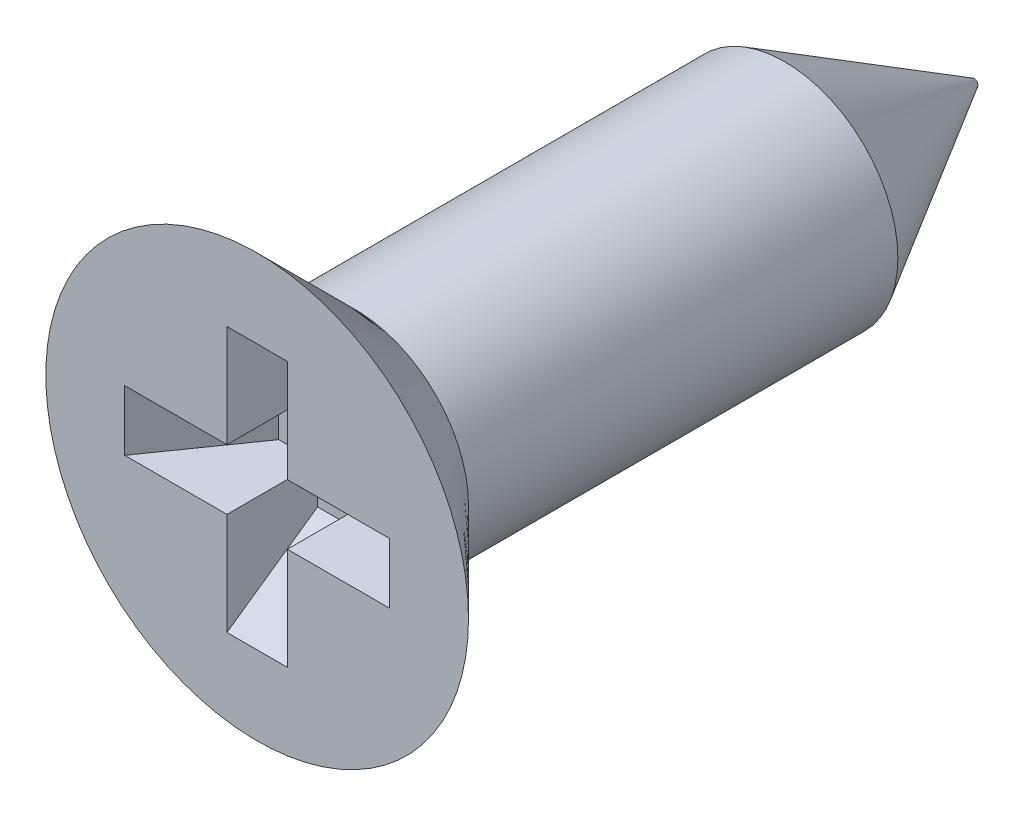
ISO-10303-21;
HEADER;
FILE_DESCRIPTION(('STEP AP214'),'2;1');
FILE_NAME('part.step','',(''),(''),'','','');
FILE_SCHEMA(('AUTOMOTIVE_DESIGN { 1 0 10303 214 1 1 1 1 }'));
ENDSEC;
DATA;
#1=APPLICATION_CONTEXT('core data for automotive mechanical design processes');
#2=APPLICATION_PROTOCOL_DEFINITION('international standard','automotive_design',2000,#1);
#3=PRODUCT_CONTEXT('',#1,'mechanical');
#4=PRODUCT('Part','Part','',(#3));
#5=PRODUCT_RELATED_PRODUCT_CATEGORY('part','',(#4));
#6=PRODUCT_DEFINITION_FORMATION('','',#4);
#7=PRODUCT_DEFINITION_CONTEXT('part definition',#1,'design');
#8=PRODUCT_DEFINITION('design','',#6,#7);
#9=PRODUCT_DEFINITION_SHAPE('','',#8);
#10=(LENGTH_UNIT() NAMED_UNIT(*) SI_UNIT(.MILLI.,.METRE.));
#11=(NAMED_UNIT(*) PLANE_ANGLE_UNIT() SI_UNIT($,.RADIAN.));
#12=(NAMED_UNIT(*) SI_UNIT($,.STERADIAN.) SOLID_ANGLE_UNIT());
#13=UNCERTAINTY_MEASURE_WITH_UNIT(LENGTH_MEASURE(1.E-05),#10,'distance_accuracy_value','');
#14=(GEOMETRIC_REPRESENTATION_CONTEXT(3) GLOBAL_UNCERTAINTY_ASSIGNED_CONTEXT((#13)) GLOBAL_UNIT_ASSIGNED_CONTEXT((#10,
#11,#12)) REPRESENTATION_CONTEXT('',''));
#15=CARTESIAN_POINT('',(0.,0.,0.));
#16=DIRECTION('',(0.,0.,1.));
#17=DIRECTION('',(1.,0.,0.));
#18=AXIS2_PLACEMENT_3D('',#15,#16,#17);
#19=CARTESIAN_POINT('',(-1.75499287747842,-0.4,0.));
#20=DIRECTION('',(0.819152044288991,0.,0.573576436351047));
#21=DIRECTION('',(0.573576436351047,0.,-0.819152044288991));
#22=AXIS2_PLACEMENT_3D('',#19,#20,#21);
#23=PLANE('',#22);
#24=DIRECTION('',(0.,1.,0.));
#25=VECTOR('',#24,1.);
#26=CARTESIAN_POINT('',(0.,0.4,-2.50638957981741));
#27=LINE('',#26,#25);
#28=CARTESIAN_POINT('',(0.,-0.29361042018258,-2.50638957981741));
#29=VERTEX_POINT('',#28);
#30=CARTESIAN_POINT('',(0.,0.,-2.50638957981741));
#31=VERTEX_POINT('',#30);
#32=EDGE_CURVE('E345',#29,#31,#27,.T.);
#33=ORIENTED_EDGE('',*,*,#32,.F.);
#34=CARTESIAN_POINT('',(0.103438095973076,-0.102874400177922,-2.65411449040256));
#35=CARTESIAN_POINT('',(0.09992365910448,-0.113485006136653,-2.64909535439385));
#36=CARTESIAN_POINT('',(0.096077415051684,-0.123726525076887,-2.64360234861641));
#37=CARTESIAN_POINT('',(0.0878958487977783,-0.143557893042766,-2.63191786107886));
#38=CARTESIAN_POINT('',(0.0835619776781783,-0.153149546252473,-2.62572845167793));
#39=CARTESIAN_POINT('',(0.0745900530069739,-0.171760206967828,-2.61291521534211));
#40=CARTESIAN_POINT('',(0.0699544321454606,-0.180782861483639,-2.60629486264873));
#41=CARTESIAN_POINT('',(0.0604348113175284,-0.198432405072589,-2.59269943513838));
#42=CARTESIAN_POINT('',(0.0555506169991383,-0.207058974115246,-2.58572408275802));
#43=CARTESIAN_POINT('',(0.0425194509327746,-0.229237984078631,-2.56711364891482));
#44=CARTESIAN_POINT('',(0.0342270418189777,-0.242528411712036,-2.55527086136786));
#45=CARTESIAN_POINT('',(0.0172728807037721,-0.268554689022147,-2.5310578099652));
#46=CARTESIAN_POINT('',(0.00860925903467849,-0.28128685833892,-2.51868487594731));
#47=CARTESIAN_POINT('',(-0.000140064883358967,-0.2938104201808,-2.50618954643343));
#48=B_SPLINE_CURVE_WITH_KNOTS('',3,(#34,#35,#36,#37,#38,#39,#40,#41,#42,#43,#44,#45,#46,#47),
.UNSPECIFIED.,.F.,.F.,(4,2,2,2,2,2,4),(0.,0.036695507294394,0.0732845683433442,
0.109608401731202,0.145961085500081,0.204852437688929,0.264086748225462),.UNSPECIFIED.);
#49=CARTESIAN_POINT('',(0.103298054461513,-0.103298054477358,-2.65391449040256));
#50=VERTEX_POINT('',#49);
#51=EDGE_CURVE('E279',#50,#29,#48,.T.);
#52=ORIENTED_EDGE('',*,*,#51,.F.);
#53=DIRECTION('',(-0.497542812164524,0.497542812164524,0.710564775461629));
#54=VECTOR('',#53,1.);
#55=CARTESIAN_POINT('',(-1.41956594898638,1.41956594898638,-0.479039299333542));
#56=LINE('',#55,#54);
#57=EDGE_CURVE('E343',#50,#31,#56,.T.);
#58=ORIENTED_EDGE('',*,*,#57,.T.);
#59=EDGE_LOOP('',(#33,#52,#58));
#60=FACE_BOUND('',#59,.T.);
#61=ADVANCED_FACE('F17',(#60),#23,.T.);
#62=DIRECTION('',(0.,1.,0.));
#63=VECTOR('',#62,1.);
#64=CARTESIAN_POINT('',(-0.91474383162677,-0.4,-1.2));
#65=LINE('',#64,#63);
#66=CARTESIAN_POINT('',(-0.91474383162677,0.4,-1.2));
#67=VERTEX_POINT('',#66);
#68=CARTESIAN_POINT('',(-0.91474383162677,-0.4,-1.2));
#69=VERTEX_POINT('',#68);
#70=EDGE_CURVE('E339',#67,#69,#65,.F.);
#71=ORIENTED_EDGE('',*,*,#70,.F.);
#72=DIRECTION('',(0.573576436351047,0.,-0.819152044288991));
#73=VECTOR('',#72,1.);
#74=CARTESIAN_POINT('',(-1.19117730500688,0.4,-0.8052120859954));
#75=LINE('',#74,#73);
#76=CARTESIAN_POINT('',(-1.75499287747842,0.4,0.));
#77=VERTEX_POINT('',#76);
#78=EDGE_CURVE('E222',#67,#77,#75,.F.);
#79=ORIENTED_EDGE('',*,*,#78,.T.);
#80=DIRECTION('',(0.,-1.,0.));
#81=VECTOR('',#80,1.);
#82=CARTESIAN_POINT('',(-1.75499287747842,-0.4,0.));
#83=LINE('',#82,#81);
#84=CARTESIAN_POINT('',(-1.75499287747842,-0.4,0.));
#85=VERTEX_POINT('',#84);
#86=EDGE_CURVE('E163',#77,#85,#83,.T.);
#87=ORIENTED_EDGE('',*,*,#86,.T.);
#88=DIRECTION('',(0.573576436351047,0.,-0.819152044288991));
#89=VECTOR('',#88,1.);
#90=CARTESIAN_POINT('',(-1.75499287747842,-0.4,0.));
#91=LINE('',#90,#89);
#92=EDGE_CURVE('E154',#69,#85,#91,.F.);
#93=ORIENTED_EDGE('',*,*,#92,.F.);
#94=EDGE_LOOP('',(#71,#79,#87,#93));
#95=FACE_BOUND('',#94,.T.);
#96=ADVANCED_FACE('F273',(#95),#23,.T.);
#97=CARTESIAN_POINT('',(0.4,-1.75499287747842,0.));
#98=DIRECTION('',(0.,0.819152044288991,0.573576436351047));
#99=DIRECTION('',(0.,-0.573576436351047,0.819152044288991));
#100=AXIS2_PLACEMENT_3D('',#97,#98,#99);
#101=PLANE('',#100);
#102=DIRECTION('',(-1.,0.,0.));
#103=VECTOR('',#102,1.);
#104=CARTESIAN_POINT('',(0.4,-0.91474383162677,-1.2));
#105=LINE('',#104,#103);
#106=CARTESIAN_POINT('',(-0.4,-0.91474383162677,-1.2));
#107=VERTEX_POINT('',#106);
#108=CARTESIAN_POINT('',(0.4,-0.91474383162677,-1.2));
#109=VERTEX_POINT('',#108);
#110=EDGE_CURVE('E337',#107,#109,#105,.F.);
#111=ORIENTED_EDGE('',*,*,#110,.F.);
#112=DIRECTION('',(0.,0.573576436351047,-0.819152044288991));
#113=VECTOR('',#112,1.);
#114=CARTESIAN_POINT('',(-0.4,-0.74539829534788,-1.44185049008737));
#115=LINE('',#114,#113);
#116=CARTESIAN_POINT('',(-0.4,-1.75499287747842,0.));
#117=VERTEX_POINT('',#116);
#118=EDGE_CURVE('E153',#107,#117,#115,.F.);
#119=ORIENTED_EDGE('',*,*,#118,.T.);
#120=DIRECTION('',(1.,0.,0.));
#121=VECTOR('',#120,1.);
#122=CARTESIAN_POINT('',(0.4,-1.75499287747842,0.));
#123=LINE('',#122,#121);
#124=CARTESIAN_POINT('',(0.4,-1.75499287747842,0.));
#125=VERTEX_POINT('',#124);
#126=EDGE_CURVE('E169',#117,#125,#123,.T.);
#127=ORIENTED_EDGE('',*,*,#126,.T.);
#128=DIRECTION('',(0.,0.573576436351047,-0.819152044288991));
#129=VECTOR('',#128,1.);
#130=CARTESIAN_POINT('',(0.4,-1.75499287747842,0.));
#131=LINE('',#130,#129);
#132=EDGE_CURVE('E230',#109,#125,#131,.F.);
#133=ORIENTED_EDGE('',*,*,#132,.F.);
#134=EDGE_LOOP('',(#111,#119,#127,#133));
#135=FACE_BOUND('',#134,.T.);
#136=ADVANCED_FACE('F269',(#135),#101,.T.);
#137=CARTESIAN_POINT('',(-1.75499287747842,1.75499287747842,-1.2));
#138=DIRECTION('',(0.,0.,-1.));
#139=DIRECTION('',(-1.,0.,0.));
#140=AXIS2_PLACEMENT_3D('',#137,#138,#139);
#141=PLANE('',#140);
#142=DIRECTION('',(0.,-1.,0.));
#143=VECTOR('',#142,1.);
#144=CARTESIAN_POINT('',(-0.4,1.75499287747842,-1.2));
#145=LINE('',#144,#143);
#146=CARTESIAN_POINT('',(-0.4,1.54919333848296,-1.2));
#147=VERTEX_POINT('',#146);
#148=CARTESIAN_POINT('',(-0.4,0.91474383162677,-1.2));
#149=VERTEX_POINT('',#148);
#150=EDGE_CURVE('E213',#147,#149,#145,.T.);
#151=ORIENTED_EDGE('',*,*,#150,.T.);
#152=CARTESIAN_POINT('',(-0.4,0.4,-1.2));
#153=VERTEX_POINT('',#152);
#154=EDGE_CURVE('E214',#149,#153,#145,.T.);
#155=ORIENTED_EDGE('',*,*,#154,.T.);
#156=DIRECTION('',(-1.,0.,0.));
#157=VECTOR('',#156,1.);
#158=CARTESIAN_POINT('',(-1.75499287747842,0.4,-1.2));
#159=LINE('',#158,#157);
#160=EDGE_CURVE('E217',#153,#67,#159,.T.);
#161=ORIENTED_EDGE('',*,*,#160,.T.);
#162=ORIENTED_EDGE('',*,*,#70,.T.);
#163=DIRECTION('',(1.,0.,0.));
#164=VECTOR('',#163,1.);
#165=CARTESIAN_POINT('',(-1.75499287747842,-0.4,-1.2));
#166=LINE('',#165,#164);
#167=CARTESIAN_POINT('',(-0.4,-0.4,-1.2));
#168=VERTEX_POINT('',#167);
#169=EDGE_CURVE('E198',#69,#168,#166,.T.);
#170=ORIENTED_EDGE('',*,*,#169,.T.);
#171=DIRECTION('',(0.,-1.,0.));
#172=VECTOR('',#171,1.);
#173=CARTESIAN_POINT('',(-0.4,-0.4,-1.2));
#174=LINE('',#173,#172);
#175=EDGE_CURVE('E149',#168,#107,#174,.T.);
#176=ORIENTED_EDGE('',*,*,#175,.T.);
#177=ORIENTED_EDGE('',*,*,#110,.T.);
#178=DIRECTION('',(0.,1.,0.));
#179=VECTOR('',#178,1.);
#180=CARTESIAN_POINT('',(0.4,-0.4,-1.2));
#181=LINE('',#180,#179);
#182=CARTESIAN_POINT('',(0.4,-0.4,-1.2));
#183=VERTEX_POINT('',#182);
#184=EDGE_CURVE('E201',#109,#183,#181,.T.);
#185=ORIENTED_EDGE('',*,*,#184,.T.);
#186=DIRECTION('',(1.,0.,0.));
#187=VECTOR('',#186,1.);
#188=CARTESIAN_POINT('',(0.4,-0.4,-1.2));
#189=LINE('',#188,#187);
#190=CARTESIAN_POINT('',(0.91474383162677,-0.4,-1.2));
#191=VERTEX_POINT('',#190);
#192=EDGE_CURVE('E204',#183,#191,#189,.T.);
#193=ORIENTED_EDGE('',*,*,#192,.T.);
#194=DIRECTION('',(0.,-1.,0.));
#195=VECTOR('',#194,1.);
#196=CARTESIAN_POINT('',(0.91474383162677,0.4,-1.2));
#197=LINE('',#196,#195);
#198=CARTESIAN_POINT('',(0.91474383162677,0.4,-1.2));
#199=VERTEX_POINT('',#198);
#200=EDGE_CURVE('E330',#191,#199,#197,.F.);
#201=ORIENTED_EDGE('',*,*,#200,.T.);
#202=DIRECTION('',(-1.,0.,0.));
#203=VECTOR('',#202,1.);
#204=CARTESIAN_POINT('',(0.4,0.4,-1.2));
#205=LINE('',#204,#203);
#206=CARTESIAN_POINT('',(0.4,0.4,-1.2));
#207=VERTEX_POINT('',#206);
#208=EDGE_CURVE('E207',#199,#207,#205,.T.);
#209=ORIENTED_EDGE('',*,*,#208,.T.);
#210=DIRECTION('',(0.,1.,0.));
#211=VECTOR('',#210,1.);
#212=CARTESIAN_POINT('',(0.4,1.75499287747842,-1.2));
#213=LINE('',#212,#211);
#214=CARTESIAN_POINT('',(0.4,0.91474383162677,-1.2));
#215=VERTEX_POINT('',#214);
#216=EDGE_CURVE('E210',#207,#215,#213,.T.);
#217=ORIENTED_EDGE('',*,*,#216,.T.);
#218=CARTESIAN_POINT('',(0.4,1.54919333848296,-1.2));
#219=VERTEX_POINT('',#218);
#220=EDGE_CURVE('E211',#215,#219,#213,.T.);
#221=ORIENTED_EDGE('',*,*,#220,.T.);
#222=CARTESIAN_POINT('',(0.,0.,-1.2));
#223=DIRECTION('',(0.,0.,-1.));
#224=DIRECTION('',(-1.,0.,0.));
#225=AXIS2_PLACEMENT_3D('',#222,#223,#224);
#226=CIRCLE('',#225,1.6);
#227=EDGE_CURVE('E239',#147,#219,#226,.T.);
#228=ORIENTED_EDGE('',*,*,#227,.F.);
#229=EDGE_LOOP('',(#151,#155,#161,#162,#170,#176,#177,#185,#193,#201,#209,#217,#221,#228));
#230=FACE_BOUND('',#229,.T.);
#231=ADVANCED_FACE('F272',(#230),#141,.F.);
#232=CARTESIAN_POINT('',(1.75499287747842,0.4,0.));
#233=DIRECTION('',(-0.819152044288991,0.,0.573576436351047));
#234=DIRECTION('',(0.573576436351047,0.,0.819152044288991));
#235=AXIS2_PLACEMENT_3D('',#232,#233,#234);
#236=PLANE('',#235);
#237=ORIENTED_EDGE('',*,*,#200,.F.);
#238=DIRECTION('',(-0.573576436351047,0.,-0.819152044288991));
#239=VECTOR('',#238,1.);
#240=CARTESIAN_POINT('',(0.74539829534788,-0.4,-1.44185049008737));
#241=LINE('',#240,#239);
#242=CARTESIAN_POINT('',(1.75499287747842,-0.4,0.));
#243=VERTEX_POINT('',#242);
#244=EDGE_CURVE('E229',#191,#243,#241,.F.);
#245=ORIENTED_EDGE('',*,*,#244,.T.);
#246=DIRECTION('',(0.,1.,0.));
#247=VECTOR('',#246,1.);
#248=CARTESIAN_POINT('',(1.75499287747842,0.4,0.));
#249=LINE('',#248,#247);
#250=CARTESIAN_POINT('',(1.75499287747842,0.4,0.));
#251=VERTEX_POINT('',#250);
#252=EDGE_CURVE('E180',#243,#251,#249,.T.);
#253=ORIENTED_EDGE('',*,*,#252,.T.);
#254=DIRECTION('',(-0.573576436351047,0.,-0.819152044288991));
#255=VECTOR('',#254,1.);
#256=CARTESIAN_POINT('',(1.75499287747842,0.4,0.));
#257=LINE('',#256,#255);
#258=EDGE_CURVE('E227',#199,#251,#257,.F.);
#259=ORIENTED_EDGE('',*,*,#258,.F.);
#260=EDGE_LOOP('',(#237,#245,#253,#259));
#261=FACE_BOUND('',#260,.T.);
#262=ADVANCED_FACE('F309',(#261),#236,.T.);
#263=CARTESIAN_POINT('',(-0.4,1.75499287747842,-1.2));
#264=DIRECTION('',(-1.,0.,0.));
#265=DIRECTION('',(0.,-1.,0.));
#266=AXIS2_PLACEMENT_3D('',#263,#264,#265);
#267=PLANE('',#266);
#268=DIRECTION('',(0.,-0.573576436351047,-0.819152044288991));
#269=VECTOR('',#268,1.);
#270=CARTESIAN_POINT('',(-0.4,1.75499287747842,0.));
#271=LINE('',#270,#269);
#272=CARTESIAN_POINT('',(-0.399999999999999,0.0800481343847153,-2.39206899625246));
#273=VERTEX_POINT('',#272);
#274=EDGE_CURVE('E223',#273,#149,#271,.F.);
#275=ORIENTED_EDGE('',*,*,#274,.T.);
#276=ORIENTED_EDGE('',*,*,#150,.F.);
#277=CARTESIAN_POINT('',(-0.399999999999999,15.0579581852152,12.2632700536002));
#278=CARTESIAN_POINT('',(-0.399999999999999,14.5558054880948,11.7612956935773));
#279=CARTESIAN_POINT('',(-0.399999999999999,14.0536451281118,11.2593289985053));
#280=CARTESIAN_POINT('',(-0.399999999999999,13.0492997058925,10.2554201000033));
#281=CARTESIAN_POINT('',(-0.399999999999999,12.5471146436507,9.75347789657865));
#282=CARTESIAN_POINT('',(-0.4,11.5427035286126,8.74962023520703));
#283=CARTESIAN_POINT('',(-0.4,11.0404774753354,8.24770477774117));
#284=CARTESIAN_POINT('',(-0.4,10.035974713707,7.24392476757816));
#285=CARTESIAN_POINT('',(-0.4,9.53369800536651,6.74206021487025));
#286=CARTESIAN_POINT('',(-0.4,8.53379190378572,5.74313239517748));
#287=CARTESIAN_POINT('',(-0.4,8.03616325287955,5.24606838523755));
#288=CARTESIAN_POINT('',(-0.4,7.04077073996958,4.25207516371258));
#289=CARTESIAN_POINT('',(-0.4,6.54300687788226,3.75514595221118));
#290=CARTESIAN_POINT('',(-0.4,5.54723950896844,2.76153914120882));
#291=CARTESIAN_POINT('',(-0.4,5.04923600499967,2.26486153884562));
#292=CARTESIAN_POINT('',(-0.4,4.30178667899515,1.52029138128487));
#293=CARTESIAN_POINT('',(-0.4,4.05256301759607,1.27217582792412));
#294=CARTESIAN_POINT('',(-0.4,3.55386033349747,0.776201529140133));
#295=CARTESIAN_POINT('',(-0.4,3.30438131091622,0.528342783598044));
#296=CARTESIAN_POINT('',(-0.4,2.93753545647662,0.164606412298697));
#297=CARTESIAN_POINT('',(-0.4,2.82036145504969,0.0485343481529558));
#298=CARTESIAN_POINT('',(-0.4,2.58585174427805,-0.183450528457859));
#299=CARTESIAN_POINT('',(-0.4,2.46851603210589,-0.299363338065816));
#300=CARTESIAN_POINT('',(-0.4,2.23338081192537,-0.531167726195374));
#301=CARTESIAN_POINT('',(-0.4,2.11558084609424,-0.647058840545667));
#302=CARTESIAN_POINT('',(-0.4,1.8796050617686,-0.878446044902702));
#303=CARTESIAN_POINT('',(-0.4,1.76142926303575,-0.993942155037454));
#304=CARTESIAN_POINT('',(-0.4,1.56017330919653,-1.18948487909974));
#305=CARTESIAN_POINT('',(-0.4,1.47726626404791,-1.26970931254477));
#306=CARTESIAN_POINT('',(-0.4,1.3109062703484,-1.42961730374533));
#307=CARTESIAN_POINT('',(-0.4,1.22745323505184,-1.5093007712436));
#308=CARTESIAN_POINT('',(-0.4,1.05990662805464,-1.66747507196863));
#309=CARTESIAN_POINT('',(-0.4,0.975815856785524,-1.74596884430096));
#310=CARTESIAN_POINT('',(-0.4,0.848350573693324,-1.8622334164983));
#311=CARTESIAN_POINT('',(-0.4,0.805646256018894,-1.9007373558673));
#312=CARTESIAN_POINT('',(-0.4,0.719561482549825,-1.97697966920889));
#313=CARTESIAN_POINT('',(-0.4,0.676181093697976,-2.01471811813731));
#314=CARTESIAN_POINT('',(-0.4,0.592876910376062,-2.08511456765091));
#315=CARTESIAN_POINT('',(-0.4,0.553057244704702,-2.11789551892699));
#316=CARTESIAN_POINT('',(-0.4,0.471811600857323,-2.18196758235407));
#317=CARTESIAN_POINT('',(-0.4,0.430377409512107,-2.21324856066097));
#318=CARTESIAN_POINT('',(-0.4,0.366190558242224,-2.25791062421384));
#319=CARTESIAN_POINT('',(-0.4,0.344296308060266,-2.27251479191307));
#320=CARTESIAN_POINT('',(-0.4,0.299692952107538,-2.30048853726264));
#321=CARTESIAN_POINT('',(-0.4,0.276983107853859,-2.31385695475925));
#322=CARTESIAN_POINT('',(-0.4,0.230746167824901,-2.33862577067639));
#323=CARTESIAN_POINT('',(-0.4,0.207227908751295,-2.35004229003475));
#324=CARTESIAN_POINT('',(-0.4,0.159057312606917,-2.37009132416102));
#325=CARTESIAN_POINT('',(-0.4,0.134407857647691,-2.37873050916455));
#326=CARTESIAN_POINT('',(-0.4,0.0836001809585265,-2.3920966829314));
#327=CARTESIAN_POINT('',(-0.4,0.0574247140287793,-2.39676217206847));
#328=CARTESIAN_POINT('',(-0.4,0.0047203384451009,-2.4008277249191));
#329=CARTESIAN_POINT('',(-0.4,-0.0218072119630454,-2.40024417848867));
#330=CARTESIAN_POINT('',(-0.4,-0.0740664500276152,-2.394031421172));
#331=CARTESIAN_POINT('',(-0.4,-0.0998019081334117,-2.38843198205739));
#332=CARTESIAN_POINT('',(-0.4,-0.137559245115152,-2.37718134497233));
#333=CARTESIAN_POINT('',(-0.4,-0.150037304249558,-2.37294020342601));
#334=CARTESIAN_POINT('',(-0.4,-0.174694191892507,-2.36366501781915));
#335=CARTESIAN_POINT('',(-0.4,-0.186873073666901,-2.35863111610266));
#336=CARTESIAN_POINT('',(-0.4,-0.221460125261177,-2.34323447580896));
#337=CARTESIAN_POINT('',(-0.4,-0.243504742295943,-2.33205986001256));
#338=CARTESIAN_POINT('',(-0.4,-0.28674808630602,-2.30816513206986));
#339=CARTESIAN_POINT('',(-0.4,-0.307945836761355,-2.2954433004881));
#340=CARTESIAN_POINT('',(-0.4,-0.370676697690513,-2.25562796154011));
#341=CARTESIAN_POINT('',(-0.4,-0.411199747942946,-2.22695881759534));
#342=CARTESIAN_POINT('',(-0.4,-0.491046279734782,-2.16720199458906));
#343=CARTESIAN_POINT('',(-0.4,-0.530352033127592,-2.13609149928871));
#344=CARTESIAN_POINT('',(-0.4,-0.607844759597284,-2.07268891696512));
#345=CARTESIAN_POINT('',(-0.4,-0.646034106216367,-2.04039972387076));
#346=CARTESIAN_POINT('',(-0.4,-0.720929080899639,-1.97574798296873));
#347=CARTESIAN_POINT('',(-0.4,-0.757648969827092,-1.94340180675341));
#348=CARTESIAN_POINT('',(-0.4,-0.830642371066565,-1.8782086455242));
#349=CARTESIAN_POINT('',(-0.4,-0.866915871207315,-1.84536164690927));
#350=CARTESIAN_POINT('',(-0.4,-0.97527461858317,-1.74629556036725));
#351=CARTESIAN_POINT('',(-0.4,-1.04688735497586,-1.67956084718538));
#352=CARTESIAN_POINT('',(-0.4,-1.1894988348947,-1.54527111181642));
#353=CARTESIAN_POINT('',(-0.4,-1.26049672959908,-1.47771519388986));
#354=CARTESIAN_POINT('',(-0.4,-1.40204788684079,-1.34215102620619));
#355=CARTESIAN_POINT('',(-0.4,-1.47260118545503,-1.27414281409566));
#356=CARTESIAN_POINT('',(-0.4,-1.61263010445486,-1.1385931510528));
#357=CARTESIAN_POINT('',(-0.4,-1.68210893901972,-1.07105501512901));
#358=CARTESIAN_POINT('',(-0.4,-1.82087103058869,-0.935775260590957));
#359=CARTESIAN_POINT('',(-0.4,-1.89015428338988,-0.868033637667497));
#360=CARTESIAN_POINT('',(-0.4,-2.09772182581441,-0.664662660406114));
#361=CARTESIAN_POINT('',(-0.4,-2.23579508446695,-0.528818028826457));
#362=CARTESIAN_POINT('',(-0.4,-2.64691525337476,-0.123422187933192));
#363=CARTESIAN_POINT('',(-0.4,-2.9195143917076,0.146582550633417));
#364=CARTESIAN_POINT('',(-0.4,-3.46422315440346,0.687087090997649));
#365=CARTESIAN_POINT('',(-0.4,-3.73633277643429,0.957586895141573));
#366=CARTESIAN_POINT('',(-0.4,-4.28035165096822,1.4989153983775));
#367=CARTESIAN_POINT('',(-0.4,-4.55226084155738,1.76974415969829));
#368=CARTESIAN_POINT('',(-0.4,-5.09592685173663,2.31155357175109));
#369=CARTESIAN_POINT('',(-0.4,-5.3676836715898,2.58253422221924));
#370=CARTESIAN_POINT('',(-0.4,-6.19795427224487,3.41071951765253));
#371=CARTESIAN_POINT('',(-0.4,-6.75631703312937,3.96807555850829));
#372=CARTESIAN_POINT('',(-0.4,-7.59365945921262,4.80417361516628));
#373=CARTESIAN_POINT('',(-0.4,-7.87270550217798,5.08284918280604));
#374=CARTESIAN_POINT('',(-0.4,-8.43076267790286,5.64023492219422));
#375=CARTESIAN_POINT('',(-0.4,-8.70977381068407,5.91894509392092));
#376=CARTESIAN_POINT('',(-0.4,-8.98877231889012,6.19766790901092));
#377=B_SPLINE_CURVE_WITH_KNOTS('',3,(#277,#278,#279,#280,#281,#282,#283,#284,#285,#286,#287,
#288,#289,#290,#291,#292,#293,#294,#295,#296,#297,#298,#299,#300,#301,#302,#303,#304,#305,#306,
#307,#308,#309,#310,#311,#312,#313,#314,#315,#316,#317,#318,#319,#320,#321,#322,#323,#324,#325,
#326,#327,#328,#329,#330,#331,#332,#333,#334,#335,#336,#337,#338,#339,#340,#341,#342,#343,#344,
#345,#346,#347,#348,#349,#350,#351,#352,#353,#354,#355,#356,#357,#358,#359,#360,#361,#362,#363,
#364,#365,#366,#367,#368,#369,#370,#371,#372,#373,#374,#375,#376),.UNSPECIFIED.,.F.,.F.,(4,2,2,
2,2,2,2,2,2,2,2,2,2,2,2,2,2,2,2,2,2,2,2,2,2,2,2,2,2,2,2,2,2,2,2,2,2,2,2,2,2,2,2,2,2,2,2,2,2,4),
(0.,2.13007518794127,4.26015084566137,6.39025675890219,8.5203622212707,10.630424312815,
12.7404877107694,14.8505265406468,15.905544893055,16.9605627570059,17.4553578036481,
17.9501616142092,18.4459113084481,18.9416353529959,19.2877342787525,19.6338895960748,
19.9789680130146,20.1514624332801,20.3239398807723,20.4786541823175,20.6342979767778,
20.7132243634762,20.7922241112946,20.8705360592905,20.9486584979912,21.0279691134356,
21.1070321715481,21.1856290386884,21.2251461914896,21.2646562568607,21.3387009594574,
21.412828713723,21.5615772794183,21.7119356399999,21.8619468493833,22.0087463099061,
22.1555497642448,22.4491996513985,22.7432052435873,23.0371866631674,23.3278722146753,
23.6185639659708,24.1996497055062,25.3506976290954,26.5017510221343,27.6530742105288,
28.8043954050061,31.1711932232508,32.3542996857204,33.5374054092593),.UNSPECIFIED.);
#378=CARTESIAN_POINT('',(-0.4,1.4456832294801,-1.3));
#379=VERTEX_POINT('',#378);
#380=EDGE_CURVE('E256',#379,#147,#377,.F.);
#381=ORIENTED_EDGE('',*,*,#380,.F.);
#382=EDGE_CURVE('E324',#273,#379,#377,.F.);
#383=ORIENTED_EDGE('',*,*,#382,.F.);
#384=EDGE_LOOP('',(#275,#276,#381,#383));
#385=FACE_BOUND('',#384,.T.);
#386=ADVANCED_FACE('F320',(#385),#267,.T.);
#387=CARTESIAN_POINT('',(0.4,1.75499287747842,-1.2));
#388=DIRECTION('',(1.,0.,0.));
#389=DIRECTION('',(0.,0.,-1.));
#390=AXIS2_PLACEMENT_3D('',#387,#388,#389);
#391=PLANE('',#390);
#392=ORIENTED_EDGE('',*,*,#220,.F.);
#393=DIRECTION('',(0.,-0.573576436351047,-0.819152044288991));
#394=VECTOR('',#393,1.);
#395=CARTESIAN_POINT('',(0.4,1.19117730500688,-0.8052120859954));
#396=LINE('',#395,#394);
#397=CARTESIAN_POINT('',(0.4,0.080048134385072,-2.39206899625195));
#398=VERTEX_POINT('',#397);
#399=EDGE_CURVE('E226',#398,#215,#396,.F.);
#400=ORIENTED_EDGE('',*,*,#399,.F.);
#401=CARTESIAN_POINT('',(0.4,-8.98877231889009,6.19766790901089));
#402=CARTESIAN_POINT('',(0.4,-8.67677785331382,5.88598452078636));
#403=CARTESIAN_POINT('',(0.4,-8.36476980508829,5.57431472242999));
#404=CARTESIAN_POINT('',(0.4,-7.74070720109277,4.95101906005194));
#405=CARTESIAN_POINT('',(0.4,-7.42865264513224,4.63939319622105));
#406=CARTESIAN_POINT('',(0.4,-6.80445030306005,4.01617482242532));
#407=CARTESIAN_POINT('',(0.4,-6.49230251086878,3.70458231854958));
#408=CARTESIAN_POINT('',(0.4,-5.86791216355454,3.08149481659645));
#409=CARTESIAN_POINT('',(0.4,-5.55566960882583,2.76999981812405));
#410=CARTESIAN_POINT('',(0.4,-4.93358205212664,2.14971502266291));
#411=CARTESIAN_POINT('',(0.4,-4.6237383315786,1.84092394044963));
#412=CARTESIAN_POINT('',(0.4,-4.00378028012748,1.22360590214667));
#413=CARTESIAN_POINT('',(0.4,-3.69366594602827,0.915078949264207));
#414=CARTESIAN_POINT('',(0.4,-3.2280826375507,0.452721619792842));
#415=CARTESIAN_POINT('',(0.4,-3.07282418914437,0.298679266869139));
#416=CARTESIAN_POINT('',(0.4,-2.76208514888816,-0.00918294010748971));
#417=CARTESIAN_POINT('',(0.4,-2.60660455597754,-0.163002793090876));
#418=CARTESIAN_POINT('',(0.4,-2.2952766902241,-0.47026389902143));
#419=CARTESIAN_POINT('',(0.4,-2.13942942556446,-0.623705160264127));
#420=CARTESIAN_POINT('',(0.4,-1.82707739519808,-0.929916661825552));
#421=CARTESIAN_POINT('',(0.4,-1.67057263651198,-1.08268690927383));
#422=CARTESIAN_POINT('',(0.4,-1.4712876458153,-1.27534266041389));
#423=CARTESIAN_POINT('',(0.4,-1.42919052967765,-1.31593419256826));
#424=CARTESIAN_POINT('',(0.4,-1.34485413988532,-1.39696971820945));
#425=CARTESIAN_POINT('',(0.4,-1.30261486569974,-1.43741371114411));
#426=CARTESIAN_POINT('',(0.4,-1.21790078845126,-1.51815834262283));
#427=CARTESIAN_POINT('',(0.4,-1.17542576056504,-1.5584587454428));
#428=CARTESIAN_POINT('',(0.4,-1.09022739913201,-1.63879610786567));
#429=CARTESIAN_POINT('',(0.4,-1.04750406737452,-1.67883306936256));
#430=CARTESIAN_POINT('',(0.4,-0.946477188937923,-1.77269586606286));
#431=CARTESIAN_POINT('',(0.4,-0.888030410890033,-1.82636758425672));
#432=CARTESIAN_POINT('',(0.4,-0.770250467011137,-1.93246551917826));
#433=CARTESIAN_POINT('',(0.4,-0.710919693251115,-1.98489435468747));
#434=CARTESIAN_POINT('',(0.4,-0.609163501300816,-2.07156587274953));
#435=CARTESIAN_POINT('',(0.4,-0.567230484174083,-2.10638522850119));
#436=CARTESIAN_POINT('',(0.4,-0.481616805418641,-2.17449372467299));
#437=CARTESIAN_POINT('',(0.4,-0.437925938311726,-2.20777040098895));
#438=CARTESIAN_POINT('',(0.4,-0.370106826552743,-2.25527989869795));
#439=CARTESIAN_POINT('',(0.4,-0.346914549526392,-2.2708361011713));
#440=CARTESIAN_POINT('',(0.4,-0.299611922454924,-2.30057434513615));
#441=CARTESIAN_POINT('',(0.4,-0.275500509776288,-2.31475472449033));
#442=CARTESIAN_POINT('',(0.4,-0.226415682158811,-2.34083021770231));
#443=CARTESIAN_POINT('',(0.4,-0.201456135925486,-2.35275078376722));
#444=CARTESIAN_POINT('',(0.4,-0.150247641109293,-2.37335246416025));
#445=CARTESIAN_POINT('',(0.4,-0.124002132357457,-2.3820417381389));
#446=CARTESIAN_POINT('',(0.4,-0.0712736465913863,-2.39447099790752));
#447=CARTESIAN_POINT('',(0.4,-0.0448320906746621,-2.39837555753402));
#448=CARTESIAN_POINT('',(0.4,0.00826983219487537,-2.40078938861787));
#449=CARTESIAN_POINT('',(0.4,0.0349297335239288,-2.39930811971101));
#450=CARTESIAN_POINT('',(0.4,0.0872151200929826,-2.39142094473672));
#451=CARTESIAN_POINT('',(0.4,0.112847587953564,-2.38505800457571));
#452=CARTESIAN_POINT('',(0.4,0.162996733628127,-2.36872094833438));
#453=CARTESIAN_POINT('',(0.4,0.187507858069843,-2.35873067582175));
#454=CARTESIAN_POINT('',(0.4,0.250211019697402,-2.32944881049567));
#455=CARTESIAN_POINT('',(0.4,0.287474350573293,-2.30822859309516));
#456=CARTESIAN_POINT('',(0.4,0.36001468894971,-2.26257652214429));
#457=CARTESIAN_POINT('',(0.4,0.395285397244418,-2.23813521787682));
#458=CARTESIAN_POINT('',(0.4,0.464698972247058,-2.18731247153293));
#459=CARTESIAN_POINT('',(0.4,0.498834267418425,-2.16092076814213));
#460=CARTESIAN_POINT('',(0.4,0.566167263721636,-2.10707763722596));
#461=CARTESIAN_POINT('',(0.4,0.599366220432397,-2.07962775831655));
#462=CARTESIAN_POINT('',(0.4,0.688211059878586,-2.00455725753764));
#463=CARTESIAN_POINT('',(0.4,0.743294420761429,-1.95627354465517));
#464=CARTESIAN_POINT('',(0.4,0.852521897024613,-1.85861308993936));
#465=CARTESIAN_POINT('',(0.4,0.906665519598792,-1.80923580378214));
#466=CARTESIAN_POINT('',(0.4,1.0141200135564,-1.71003906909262));
#467=CARTESIAN_POINT('',(0.4,1.06743344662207,-1.66022239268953));
#468=CARTESIAN_POINT('',(0.4,1.17366653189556,-1.56017068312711));
#469=CARTESIAN_POINT('',(0.4,1.22658617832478,-1.50993564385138));
#470=CARTESIAN_POINT('',(0.4,1.34022302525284,-1.40147670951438));
#471=CARTESIAN_POINT('',(0.4,1.40089527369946,-1.34320575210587));
#472=CARTESIAN_POINT('',(0.4,1.52204643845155,-1.22635067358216));
#473=CARTESIAN_POINT('',(0.4,1.58252512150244,-1.16776631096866));
#474=CARTESIAN_POINT('',(0.4,1.76134257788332,-0.994028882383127));
#475=CARTESIAN_POINT('',(0.4,1.87943072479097,-0.878617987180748));
#476=CARTESIAN_POINT('',(0.4,2.11522557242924,-0.647406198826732));
#477=CARTESIAN_POINT('',(0.4,2.2329322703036,-0.531605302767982));
#478=CARTESIAN_POINT('',(0.4,2.58561472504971,-0.18393263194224));
#479=CARTESIAN_POINT('',(0.4,2.82024009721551,0.0482944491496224));
#480=CARTESIAN_POINT('',(0.4,3.26821543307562,0.492493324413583));
#481=CARTESIAN_POINT('',(0.4,3.48160116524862,0.704429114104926));
#482=CARTESIAN_POINT('',(0.4,3.90816301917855,1.12851207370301));
#483=CARTESIAN_POINT('',(0.4,4.12133914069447,1.34065924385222));
#484=CARTESIAN_POINT('',(0.4,4.76075243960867,1.97736484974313));
#485=CARTESIAN_POINT('',(0.4,5.18680015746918,2.40211347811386));
#486=CARTESIAN_POINT('',(0.4,6.40063874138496,3.61287974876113));
#487=CARTESIAN_POINT('',(0.4,7.18816227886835,4.39916530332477));
#488=CARTESIAN_POINT('',(0.4,8.76295040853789,5.97199608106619));
#489=CARTESIAN_POINT('',(0.4,9.55021500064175,6.75854130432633));
#490=CARTESIAN_POINT('',(0.4,11.1242654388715,8.33141136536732));
#491=CARTESIAN_POINT('',(0.4,11.9110513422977,9.1177361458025));
#492=CARTESIAN_POINT('',(0.4,13.4845477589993,10.6904604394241));
#493=CARTESIAN_POINT('',(0.4,14.2712582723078,11.4768599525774));
#494=CARTESIAN_POINT('',(0.4,15.0579581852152,12.2632700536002));
#495=B_SPLINE_CURVE_WITH_KNOTS('',3,(#401,#402,#403,#404,#405,#406,#407,#408,#409,#410,#411,
#412,#413,#414,#415,#416,#417,#418,#419,#420,#421,#422,#423,#424,#425,#426,#427,#428,#429,#430,
#431,#432,#433,#434,#435,#436,#437,#438,#439,#440,#441,#442,#443,#444,#445,#446,#447,#448,#449,
#450,#451,#452,#453,#454,#455,#456,#457,#458,#459,#460,#461,#462,#463,#464,#465,#466,#467,#468,
#469,#470,#471,#472,#473,#474,#475,#476,#477,#478,#479,#480,#481,#482,#483,#484,#485,#486,#487,
#488,#489,#490,#491,#492,#493,#494),.UNSPECIFIED.,.F.,.F.,(4,2,2,2,2,2,2,2,2,2,2,2,2,2,2,2,2,2,
2,2,2,2,2,2,2,2,2,2,2,2,2,2,2,2,2,2,2,2,2,2,2,2,2,2,2,2,4),(0.,1.3230206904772,2.64604695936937,
3.96920045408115,5.29234851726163,6.60467298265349,7.91701316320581,8.57314423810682,
9.22927845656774,9.88539816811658,10.5415108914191,10.7169488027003,10.8923873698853,
11.0680404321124,11.2436922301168,11.4817424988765,11.7192361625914,11.8827337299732,
12.0473795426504,12.1311266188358,12.2149736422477,12.2978114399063,12.3804386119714,
12.4601358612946,12.5396931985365,12.6185582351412,12.6977789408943,12.8260633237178,
12.9547328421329,13.0841355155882,13.2133555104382,13.4330718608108,13.6529001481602,
13.8717938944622,14.0906908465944,14.3430576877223,14.5956600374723,15.091016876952,
15.5863774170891,16.5767323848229,17.4789808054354,18.3812302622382,20.1860437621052,
23.5245978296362,26.8631529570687,30.2002247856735,33.5372951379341),.UNSPECIFIED.);
#496=CARTESIAN_POINT('',(0.4,1.4456832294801,-1.3));
#497=VERTEX_POINT('',#496);
#498=EDGE_CURVE('E242',#497,#398,#495,.F.);
#499=ORIENTED_EDGE('',*,*,#498,.F.);
#500=EDGE_CURVE('E331',#219,#497,#495,.F.);
#501=ORIENTED_EDGE('',*,*,#500,.F.);
#502=EDGE_LOOP('',(#392,#400,#499,#501));
#503=FACE_BOUND('',#502,.T.);
#504=ADVANCED_FACE('F369',(#503),#391,.T.);
#505=CARTESIAN_POINT('',(0.,0.,-1.3));
#506=DIRECTION('',(0.,0.,1.));
#507=DIRECTION('',(1.,0.,0.));
#508=AXIS2_PLACEMENT_3D('',#505,#506,#507);
#509=CONICAL_SURFACE('',#508,1.5,0.78539816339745);
#510=CARTESIAN_POINT('',(0.,0.,-1.3));
#511=DIRECTION('',(0.,0.,1.));
#512=DIRECTION('',(1.,0.,0.));
#513=AXIS2_PLACEMENT_3D('',#510,#511,#512);
#514=CIRCLE('',#513,1.5);
#515=EDGE_CURVE('E232',#497,#379,#514,.T.);
#516=ORIENTED_EDGE('',*,*,#515,.T.);
#517=ORIENTED_EDGE('',*,*,#380,.T.);
#518=ORIENTED_EDGE('',*,*,#227,.T.);
#519=ORIENTED_EDGE('',*,*,#500,.T.);
#520=EDGE_LOOP('',(#516,#517,#518,#519));
#521=FACE_BOUND('',#520,.T.);
#522=ADVANCED_FACE('F427',(#521),#509,.T.);
#523=CARTESIAN_POINT('',(0.,2.8,0.));
#524=DIRECTION('',(0.,0.,-1.));
#525=DIRECTION('',(-1.,0.,0.));
#526=AXIS2_PLACEMENT_3D('',#523,#524,#525);
#527=PLANE('',#526);
#528=DIRECTION('',(1.,0.,0.));
#529=VECTOR('',#528,1.);
#530=CARTESIAN_POINT('',(-1.75499287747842,-0.4,0.));
#531=LINE('',#530,#529);
#532=CARTESIAN_POINT('',(-0.4,-0.4,0.));
#533=VERTEX_POINT('',#532);
#534=EDGE_CURVE('E157',#85,#533,#531,.T.);
#535=ORIENTED_EDGE('',*,*,#534,.F.);
#536=ORIENTED_EDGE('',*,*,#86,.F.);
#537=DIRECTION('',(-1.,0.,0.));
#538=VECTOR('',#537,1.);
#539=CARTESIAN_POINT('',(-1.75499287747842,0.4,0.));
#540=LINE('',#539,#538);
#541=CARTESIAN_POINT('',(-0.4,0.4,0.));
#542=VERTEX_POINT('',#541);
#543=EDGE_CURVE('E195',#542,#77,#540,.T.);
#544=ORIENTED_EDGE('',*,*,#543,.F.);
#545=DIRECTION('',(0.,-1.,0.));
#546=VECTOR('',#545,1.);
#547=CARTESIAN_POINT('',(-0.4,1.75499287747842,0.));
#548=LINE('',#547,#546);
#549=CARTESIAN_POINT('',(-0.4,1.75499287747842,0.));
#550=VERTEX_POINT('',#549);
#551=EDGE_CURVE('E192',#550,#542,#548,.T.);
#552=ORIENTED_EDGE('',*,*,#551,.F.);
#553=DIRECTION('',(-1.,0.,0.));
#554=VECTOR('',#553,1.);
#555=CARTESIAN_POINT('',(-0.4,1.75499287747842,0.));
#556=LINE('',#555,#554);
#557=CARTESIAN_POINT('',(0.4,1.75499287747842,0.));
#558=VERTEX_POINT('',#557);
#559=EDGE_CURVE('E189',#558,#550,#556,.T.);
#560=ORIENTED_EDGE('',*,*,#559,.F.);
#561=DIRECTION('',(0.,1.,0.));
#562=VECTOR('',#561,1.);
#563=CARTESIAN_POINT('',(0.4,1.75499287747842,0.));
#564=LINE('',#563,#562);
#565=CARTESIAN_POINT('',(0.4,0.4,0.));
#566=VERTEX_POINT('',#565);
#567=EDGE_CURVE('E186',#566,#558,#564,.T.);
#568=ORIENTED_EDGE('',*,*,#567,.F.);
#569=DIRECTION('',(-1.,0.,0.));
#570=VECTOR('',#569,1.);
#571=CARTESIAN_POINT('',(0.4,0.4,0.));
#572=LINE('',#571,#570);
#573=EDGE_CURVE('E183',#251,#566,#572,.T.);
#574=ORIENTED_EDGE('',*,*,#573,.F.);
#575=ORIENTED_EDGE('',*,*,#252,.F.);
#576=DIRECTION('',(1.,0.,0.));
#577=VECTOR('',#576,1.);
#578=CARTESIAN_POINT('',(0.4,-0.4,0.));
#579=LINE('',#578,#577);
#580=CARTESIAN_POINT('',(0.4,-0.4,0.));
#581=VERTEX_POINT('',#580);
#582=EDGE_CURVE('E177',#581,#243,#579,.T.);
#583=ORIENTED_EDGE('',*,*,#582,.F.);
#584=DIRECTION('',(0.,1.,0.));
#585=VECTOR('',#584,1.);
#586=CARTESIAN_POINT('',(0.4,-0.4,0.));
#587=LINE('',#586,#585);
#588=EDGE_CURVE('E171',#125,#581,#587,.T.);
#589=ORIENTED_EDGE('',*,*,#588,.F.);
#590=ORIENTED_EDGE('',*,*,#126,.F.);
#591=DIRECTION('',(0.,-1.,0.));
#592=VECTOR('',#591,1.);
#593=CARTESIAN_POINT('',(-0.4,-0.4,0.));
#594=LINE('',#593,#592);
#595=EDGE_CURVE('E146',#533,#117,#594,.T.);
#596=ORIENTED_EDGE('',*,*,#595,.F.);
#597=EDGE_LOOP('',(#535,#536,#544,#552,#560,#568,#574,#575,#583,#589,#590,#596));
#598=FACE_BOUND('',#597,.T.);
#599=CARTESIAN_POINT('',(0.,0.,0.));
#600=DIRECTION('',(0.,0.,1.));
#601=DIRECTION('',(1.,0.,0.));
#602=AXIS2_PLACEMENT_3D('',#599,#600,#601);
#603=CIRCLE('',#602,2.8);
#604=CARTESIAN_POINT('',(2.8,0.,0.));
#605=VERTEX_POINT('',#604);
#606=EDGE_CURVE('E235',#605,#605,#603,.T.);
#607=ORIENTED_EDGE('',*,*,#606,.T.);
#608=EDGE_LOOP('',(#607));
#609=FACE_BOUND('',#608,.T.);
#610=ADVANCED_FACE('F165',(#598,#609),#527,.F.);
#611=CARTESIAN_POINT('',(0.,0.,-2.79999999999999));
#612=VERTEX_POINT('',#611);
#613=VERTEX_LOOP('',#612);
#614=FACE_BOUND('',#613,.T.);
#615=ORIENTED_EDGE('',*,*,#382,.T.);
#616=EDGE_CURVE('E236',#379,#497,#514,.T.);
#617=ORIENTED_EDGE('',*,*,#616,.T.);
#618=ORIENTED_EDGE('',*,*,#498,.T.);
#619=CARTESIAN_POINT('',(0.400000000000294,0.0800481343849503,-2.39206899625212));
#620=CARTESIAN_POINT('',(0.386959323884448,0.0696774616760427,-2.40687985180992));
#621=CARTESIAN_POINT('',(0.3737879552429,0.0593585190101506,-2.4216168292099));
#622=CARTESIAN_POINT('',(0.347052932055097,0.0388678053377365,-2.45088060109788));
#623=CARTESIAN_POINT('',(0.333488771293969,0.0286962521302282,-2.46540708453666));
#624=CARTESIAN_POINT('',(0.305785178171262,0.00850918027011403,-2.49423721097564));
#625=CARTESIAN_POINT('',(0.291642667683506,-0.00150495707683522,-2.50853888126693));
#626=CARTESIAN_POINT('',(0.2626845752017,-0.0212018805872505,-2.53666900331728));
#627=CARTESIAN_POINT('',(0.247869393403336,-0.0308848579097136,-2.55049772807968));
#628=CARTESIAN_POINT('',(0.219489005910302,-0.0483734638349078,-2.57547404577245));
#629=CARTESIAN_POINT('',(0.206053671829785,-0.0562478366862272,-2.5867198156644));
#630=CARTESIAN_POINT('',(0.178175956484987,-0.0714244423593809,-2.60839425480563));
#631=CARTESIAN_POINT('',(0.163732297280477,-0.0787259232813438,-2.6188218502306));
#632=CARTESIAN_POINT('',(0.135640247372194,-0.0913614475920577,-2.63686724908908));
#633=CARTESIAN_POINT('',(0.122175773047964,-0.0968274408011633,-2.64467349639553));
#634=CARTESIAN_POINT('',(0.0939730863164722,-0.106540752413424,-2.65854554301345));
#635=CARTESIAN_POINT('',(0.0792408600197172,-0.110793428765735,-2.66461899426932));
#636=CARTESIAN_POINT('',(0.0543487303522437,-0.116076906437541,-2.67216458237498));
#637=CARTESIAN_POINT('',(0.0445913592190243,-0.117717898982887,-2.67450816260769));
#638=CARTESIAN_POINT('',(0.0247347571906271,-0.120043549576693,-2.67782953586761));
#639=CARTESIAN_POINT('',(0.0146359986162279,-0.120729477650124,-2.67880914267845));
#640=CARTESIAN_POINT('',(-0.00565186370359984,-0.121040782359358,-2.67925373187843));
#641=CARTESIAN_POINT('',(-0.0158411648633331,-0.120662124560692,-2.67871295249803));
#642=CARTESIAN_POINT('',(-0.0359456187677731,-0.118897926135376,-2.67619341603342));
#643=CARTESIAN_POINT('',(-0.0458605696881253,-0.117511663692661,-2.67421362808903));
#644=CARTESIAN_POINT('',(-0.0692169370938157,-0.113174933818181,-2.66802013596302));
#645=CARTESIAN_POINT('',(-0.0824214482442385,-0.10981471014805,-2.66322123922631));
#646=CARTESIAN_POINT('',(-0.107825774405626,-0.102003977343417,-2.65206635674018));
#647=CARTESIAN_POINT('',(-0.120020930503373,-0.0975487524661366,-2.6457036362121));
#648=CARTESIAN_POINT('',(-0.149457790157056,-0.0855385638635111,-2.62855130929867));
#649=CARTESIAN_POINT('',(-0.16615258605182,-0.0775516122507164,-2.61714476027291));
#650=CARTESIAN_POINT('',(-0.198216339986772,-0.0607344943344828,-2.59312742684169));
#651=CARTESIAN_POINT('',(-0.213581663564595,-0.0519021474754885,-2.58051352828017));
#652=CARTESIAN_POINT('',(-0.24355758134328,-0.033627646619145,-2.55441483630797));
#653=CARTESIAN_POINT('',(-0.258156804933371,-0.0241794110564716,-2.54092135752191));
#654=CARTESIAN_POINT('',(-0.286656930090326,-0.00496878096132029,-2.51348573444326));
#655=CARTESIAN_POINT('',(-0.300558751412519,0.00479317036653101,-2.49954422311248));
#656=CARTESIAN_POINT('',(-0.331139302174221,0.0269038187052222,-2.4679669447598));
#657=CARTESIAN_POINT('',(-0.347686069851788,0.0393122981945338,-2.45024579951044));
#658=CARTESIAN_POINT('',(-0.380246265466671,0.0643581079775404,-2.41447667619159));
#659=CARTESIAN_POINT('',(-0.396259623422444,0.076995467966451,-2.39642865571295));
#660=CARTESIAN_POINT('',(-0.443732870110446,0.115154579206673,-2.34193179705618));
#661=CARTESIAN_POINT('',(-0.474612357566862,0.140913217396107,-2.30514464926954));
#662=CARTESIAN_POINT('',(-0.535539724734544,0.192831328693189,-2.2309979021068));
#663=CARTESIAN_POINT('',(-0.56558559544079,0.218991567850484,-2.19363720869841));
#664=CARTESIAN_POINT('',(-0.625083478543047,0.271523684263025,-2.1186135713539));
#665=CARTESIAN_POINT('',(-0.654535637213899,0.297895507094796,-2.08095070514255));
#666=CARTESIAN_POINT('',(-0.735342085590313,0.370931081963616,-1.97664509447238));
#667=CARTESIAN_POINT('',(-0.78628433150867,0.417744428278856,-1.90978870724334));
#668=CARTESIAN_POINT('',(-0.862093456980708,0.488055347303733,-1.80937430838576));
#669=CARTESIAN_POINT('',(-0.887215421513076,0.51146302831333,-1.77594467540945));
#670=CARTESIAN_POINT('',(-0.937320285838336,0.558324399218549,-1.70901970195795));
#671=CARTESIAN_POINT('',(-0.962303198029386,0.581778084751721,-1.675524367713));
#672=CARTESIAN_POINT('',(-0.987233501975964,0.605250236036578,-1.64200266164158));
#673=B_SPLINE_CURVE_WITH_KNOTS('',3,(#619,#620,#621,#622,#623,#624,#625,#626,#627,#628,#629,
#630,#631,#632,#633,#634,#635,#636,#637,#638,#639,#640,#641,#642,#643,#644,#645,#646,#647,#648,
#649,#650,#651,#652,#653,#654,#655,#656,#657,#658,#659,#660,#661,#662,#663,#664,#665,#666,#667,
#668,#669,#670,#671,#672),.UNSPECIFIED.,.F.,.F.,(4,2,2,2,2,2,2,2,2,2,2,2,2,2,2,2,2,2,2,2,2,2,2,
2,2,2,4),(0.,0.066883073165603,0.133856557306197,0.201250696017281,0.268605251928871,
0.326201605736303,0.38387233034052,0.433256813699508,0.482419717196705,0.512806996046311,
0.543153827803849,0.573615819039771,0.604099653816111,0.64718736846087,0.690464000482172,
0.755507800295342,0.820724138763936,0.886728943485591,0.952644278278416,1.03433986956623,
1.1160461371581,1.27952551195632,1.4433696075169,1.60717283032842,1.89579587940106,
2.03956356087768,2.18331821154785),.UNSPECIFIED.);
#674=CARTESIAN_POINT('',(0.293610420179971,1.86626469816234E-12,-2.50638957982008));
#675=VERTEX_POINT('',#674);
#676=EDGE_CURVE('E250',#398,#675,#673,.T.);
#677=ORIENTED_EDGE('',*,*,#676,.T.);
#678=EDGE_CURVE('E36',#675,#50,#673,.T.);
#679=ORIENTED_EDGE('',*,*,#678,.T.);
#680=ORIENTED_EDGE('',*,*,#51,.T.);
#681=CARTESIAN_POINT('',(0.121243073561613,-0.450741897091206,-2.33323652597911));
#682=CARTESIAN_POINT('',(0.109163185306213,-0.436114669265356,-2.35048839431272));
#683=CARTESIAN_POINT('',(0.0971315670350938,-0.421361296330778,-2.3676713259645));
#684=CARTESIAN_POINT('',(0.0732067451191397,-0.391471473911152,-2.40183951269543));
#685=CARTESIAN_POINT('',(0.0613137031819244,-0.376334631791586,-2.41882453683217));
#686=CARTESIAN_POINT('',(0.03754886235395,-0.34533641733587,-2.45276424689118));
#687=CARTESIAN_POINT('',(0.0256803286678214,-0.329467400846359,-2.46971426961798));
#688=CARTESIAN_POINT('',(0.00226328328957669,-0.297038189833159,-2.50315727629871));
#689=CARTESIAN_POINT('',(-0.00928538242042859,-0.280478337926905,-2.51965048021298));
#690=CARTESIAN_POINT('',(-0.0311869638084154,-0.24739330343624,-2.55092918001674));
#691=CARTESIAN_POINT('',(-0.0415697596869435,-0.230928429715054,-2.56575734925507));
#692=CARTESIAN_POINT('',(-0.0615724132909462,-0.196727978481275,-2.59432409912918));
#693=CARTESIAN_POINT('',(-0.0711953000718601,-0.178998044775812,-2.60806700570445));
#694=CARTESIAN_POINT('',(-0.0819583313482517,-0.156421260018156,-2.62343820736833));
#695=CARTESIAN_POINT('',(-0.0837622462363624,-0.15253386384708,-2.62601446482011));
#696=CARTESIAN_POINT('',(-0.0913547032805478,-0.135659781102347,-2.63685761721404));
#697=CARTESIAN_POINT('',(-0.0968147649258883,-0.122208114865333,-2.64465539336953));
#698=CARTESIAN_POINT('',(-0.106530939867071,-0.0940059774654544,-2.65853152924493));
#699=CARTESIAN_POINT('',(-0.110789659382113,-0.0792584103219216,-2.66461361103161));
#700=CARTESIAN_POINT('',(-0.116077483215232,-0.0543461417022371,-2.67216540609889));
#701=CARTESIAN_POINT('',(-0.117718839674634,-0.0445857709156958,-2.67450950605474));
#702=CARTESIAN_POINT('',(-0.120043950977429,-0.024728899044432,-2.67783010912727));
#703=CARTESIAN_POINT('',(-0.12072952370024,-0.0146330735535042,-2.67880920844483));
#704=CARTESIAN_POINT('',(-0.12104076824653,0.00565102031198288,-2.67925371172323));
#705=CARTESIAN_POINT('',(-0.120662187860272,0.0158394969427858,-2.6787130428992));
#706=CARTESIAN_POINT('',(-0.118898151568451,0.0359440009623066,-2.67619373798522));
#707=CARTESIAN_POINT('',(-0.117511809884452,0.0458597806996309,-2.67421383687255));
#708=CARTESIAN_POINT('',(-0.113174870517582,0.0692172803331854,-2.66802004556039));
#709=CARTESIAN_POINT('',(-0.109814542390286,0.0824221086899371,-2.6632209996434));
#710=CARTESIAN_POINT('',(-0.102003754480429,0.107826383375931,-2.65206603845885));
#711=CARTESIAN_POINT('',(-0.0975486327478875,0.120021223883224,-2.64570346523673));
#712=CARTESIAN_POINT('',(-0.0855386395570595,0.149457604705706,-2.62855141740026));
#713=CARTESIAN_POINT('',(-0.0775517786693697,0.166152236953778,-2.61714499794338));
#714=CARTESIAN_POINT('',(-0.0607348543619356,0.198215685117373,-2.59312794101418));
#715=CARTESIAN_POINT('',(-0.0519026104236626,0.213580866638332,-2.58051418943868));
#716=CARTESIAN_POINT('',(-0.0336281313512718,0.243556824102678,-2.55441552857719));
#717=CARTESIAN_POINT('',(-0.0241798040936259,0.258156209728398,-2.54092191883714));
#718=CARTESIAN_POINT('',(-0.00496898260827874,0.286656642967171,-2.51348602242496));
#719=CARTESIAN_POINT('',(0.00479306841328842,0.300558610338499,-2.4995443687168));
#720=CARTESIAN_POINT('',(0.0269040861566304,0.331139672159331,-2.4679665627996));
#721=CARTESIAN_POINT('',(0.0393128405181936,0.347686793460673,-2.45024502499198));
#722=CARTESIAN_POINT('',(0.0643592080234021,0.380247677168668,-2.41447510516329));
#723=CARTESIAN_POINT('',(0.0769968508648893,0.396261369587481,-2.3964266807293));
#724=CARTESIAN_POINT('',(0.1151568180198,0.443735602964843,-2.34192859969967));
#725=CARTESIAN_POINT('',(0.140916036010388,0.474615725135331,-2.30514062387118));
#726=CARTESIAN_POINT('',(0.192835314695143,0.535544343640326,-2.23099220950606));
#727=CARTESIAN_POINT('',(0.218996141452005,0.565590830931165,-2.19363067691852));
#728=CARTESIAN_POINT('',(0.271529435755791,0.625089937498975,-2.11860535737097));
#729=CARTESIAN_POINT('',(0.297901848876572,0.654542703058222,-2.08094164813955));
#730=CARTESIAN_POINT('',(0.370936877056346,0.735348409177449,-1.97663681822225));
#731=CARTESIAN_POINT('',(0.417749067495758,0.786289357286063,-1.90978208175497));
#732=CARTESIAN_POINT('',(0.488058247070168,0.862096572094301,-1.8093701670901));
#733=CARTESIAN_POINT('',(0.511465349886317,0.887217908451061,-1.77594135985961));
#734=CARTESIAN_POINT('',(0.558325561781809,0.937321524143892,-1.70901804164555));
#735=CARTESIAN_POINT('',(0.581778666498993,0.962303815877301,-1.67552353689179));
#736=CARTESIAN_POINT('',(0.605250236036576,0.987233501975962,-1.64200266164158));
#737=B_SPLINE_CURVE_WITH_KNOTS('',3,(#681,#682,#683,#684,#685,#686,#687,#688,#689,#690,#691,
#692,#693,#694,#695,#696,#697,#698,#699,#700,#701,#702,#703,#704,#705,#706,#707,#708,#709,#710,
#711,#712,#713,#714,#715,#716,#717,#718,#719,#720,#721,#722,#723,#724,#725,#726,#727,#728,#729,
#730,#731,#732,#733,#734,#735,#736),.UNSPECIFIED.,.F.,.F.,(4,2,2,2,2,2,2,2,2,2,2,2,2,2,2,2,2,2,
2,2,2,2,2,2,2,2,2,4),(0.,0.0769296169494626,0.153941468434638,0.2321624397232,0.310345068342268,
0.383726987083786,0.45679984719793,0.471800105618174,0.521127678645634,0.570347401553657,
0.600743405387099,0.631081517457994,0.661541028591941,0.692027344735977,0.735116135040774,
0.778391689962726,0.843434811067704,0.90865046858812,0.974655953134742,1.04057196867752,
1.12226934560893,1.20397739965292,1.36746035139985,1.53130803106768,1.6951148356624,
1.98373069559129,2.12749481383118,2.27124590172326),.UNSPECIFIED.);
#738=CARTESIAN_POINT('',(-0.103298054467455,-0.103298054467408,-2.6539144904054));
#739=VERTEX_POINT('',#738);
#740=EDGE_CURVE('E284',#29,#739,#737,.T.);
#741=ORIENTED_EDGE('',*,*,#740,.T.);
#742=EDGE_CURVE('E257',#739,#273,#673,.T.);
#743=ORIENTED_EDGE('',*,*,#742,.T.);
#744=EDGE_LOOP('',(#615,#617,#618,#677,#679,#680,#741,#743));
#745=FACE_BOUND('',#744,.T.);
#746=ORIENTED_EDGE('',*,*,#606,.F.);
#747=EDGE_LOOP('',(#746));
#748=FACE_BOUND('',#747,.T.);
#749=ADVANCED_FACE('F259',(#614,#745,#748),#509,.T.);
#750=CARTESIAN_POINT('',(0.,0.,-9.5));
#751=DIRECTION('',(0.,0.,1.));
#752=DIRECTION('',(1.,0.,0.));
#753=AXIS2_PLACEMENT_3D('',#750,#751,#752);
#754=CYLINDRICAL_SURFACE('',#753,1.5);
#755=CARTESIAN_POINT('',(0.,0.,-6.98852632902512));
#756=DIRECTION('',(0.,0.,1.));
#757=DIRECTION('',(1.,0.,0.));
#758=AXIS2_PLACEMENT_3D('',#755,#756,#757);
#759=CIRCLE('',#758,1.5);
#760=CARTESIAN_POINT('',(1.5,0.,-6.98852632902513));
#761=VERTEX_POINT('',#760);
#762=EDGE_CURVE('E26',#761,#761,#759,.T.);
#763=ORIENTED_EDGE('',*,*,#762,.T.);
#764=EDGE_LOOP('',(#763));
#765=FACE_BOUND('',#764,.T.);
#766=ORIENTED_EDGE('',*,*,#515,.F.);
#767=ORIENTED_EDGE('',*,*,#616,.F.);
#768=EDGE_LOOP('',(#766,#767));
#769=FACE_BOUND('',#768,.T.);
#770=ADVANCED_FACE('F292',(#765,#769),#754,.T.);
#771=CARTESIAN_POINT('',(0.,0.,-9.5));
#772=DIRECTION('',(0.,0.,1.));
#773=DIRECTION('',(1.,0.,0.));
#774=AXIS2_PLACEMENT_3D('',#771,#772,#773);
#775=PLANE('',#774);
#776=CARTESIAN_POINT('',(0.,0.,-9.5));
#777=DIRECTION('',(0.,0.,1.));
#778=DIRECTION('',(1.,0.,0.));
#779=AXIS2_PLACEMENT_3D('',#776,#777,#778);
#780=CIRCLE('',#779,0.0499999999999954);
#781=CARTESIAN_POINT('',(0.0499999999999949,0.,-9.5));
#782=VERTEX_POINT('',#781);
#783=EDGE_CURVE('E11',#782,#782,#780,.F.);
#784=ORIENTED_EDGE('',*,*,#783,.T.);
#785=EDGE_LOOP('',(#784));
#786=FACE_BOUND('',#785,.T.);
#787=ADVANCED_FACE('F314',(#786),#775,.F.);
#788=CARTESIAN_POINT('',(-1.75499287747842,0.4,-1.2));
#789=DIRECTION('',(0.,1.,0.));
#790=DIRECTION('',(-1.,0.,0.));
#791=AXIS2_PLACEMENT_3D('',#788,#789,#790);
#792=PLANE('',#791);
#793=ORIENTED_EDGE('',*,*,#78,.F.);
#794=ORIENTED_EDGE('',*,*,#160,.F.);
#795=DIRECTION('',(0.,0.,1.));
#796=VECTOR('',#795,1.);
#797=CARTESIAN_POINT('',(-0.4,0.4,-1.2));
#798=LINE('',#797,#796);
#799=EDGE_CURVE('E220',#153,#542,#798,.T.);
#800=ORIENTED_EDGE('',*,*,#799,.T.);
#801=ORIENTED_EDGE('',*,*,#543,.T.);
#802=EDGE_LOOP('',(#793,#794,#800,#801));
#803=FACE_BOUND('',#802,.T.);
#804=ADVANCED_FACE('F311',(#803),#792,.F.);
#805=ORIENTED_EDGE('',*,*,#154,.F.);
#806=EDGE_CURVE('E249',#149,#550,#271,.F.);
#807=ORIENTED_EDGE('',*,*,#806,.T.);
#808=ORIENTED_EDGE('',*,*,#551,.T.);
#809=ORIENTED_EDGE('',*,*,#799,.F.);
#810=EDGE_LOOP('',(#805,#807,#808,#809));
#811=FACE_BOUND('',#810,.T.);
#812=ADVANCED_FACE('F268',(#811),#267,.F.);
#813=CARTESIAN_POINT('',(-0.4,1.75499287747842,0.));
#814=DIRECTION('',(0.,-0.819152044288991,0.573576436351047));
#815=DIRECTION('',(0.,-0.573576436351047,-0.819152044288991));
#816=AXIS2_PLACEMENT_3D('',#813,#814,#815);
#817=PLANE('',#816);
#818=ORIENTED_EDGE('',*,*,#678,.F.);
#819=ORIENTED_EDGE('',*,*,#676,.F.);
#820=ORIENTED_EDGE('',*,*,#399,.T.);
#821=EDGE_CURVE('E247',#215,#558,#396,.F.);
#822=ORIENTED_EDGE('',*,*,#821,.T.);
#823=ORIENTED_EDGE('',*,*,#559,.T.);
#824=ORIENTED_EDGE('',*,*,#806,.F.);
#825=ORIENTED_EDGE('',*,*,#274,.F.);
#826=ORIENTED_EDGE('',*,*,#742,.F.);
#827=DIRECTION('',(0.497542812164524,0.497542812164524,0.710564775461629));
#828=VECTOR('',#827,1.);
#829=CARTESIAN_POINT('',(1.41956594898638,1.41956594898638,-0.479039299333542));
#830=LINE('',#829,#828);
#831=EDGE_CURVE('E341',#739,#31,#830,.T.);
#832=ORIENTED_EDGE('',*,*,#831,.T.);
#833=ORIENTED_EDGE('',*,*,#57,.F.);
#834=EDGE_LOOP('',(#818,#819,#820,#822,#823,#824,#825,#826,#832,#833));
#835=FACE_BOUND('',#834,.T.);
#836=ADVANCED_FACE('F263',(#835),#817,.T.);
#837=ORIENTED_EDGE('',*,*,#821,.F.);
#838=ORIENTED_EDGE('',*,*,#216,.F.);
#839=DIRECTION('',(0.,0.,1.));
#840=VECTOR('',#839,1.);
#841=CARTESIAN_POINT('',(0.4,0.4,-1.2));
#842=LINE('',#841,#840);
#843=EDGE_CURVE('E224',#207,#566,#842,.T.);
#844=ORIENTED_EDGE('',*,*,#843,.T.);
#845=ORIENTED_EDGE('',*,*,#567,.T.);
#846=EDGE_LOOP('',(#837,#838,#844,#845));
#847=FACE_BOUND('',#846,.T.);
#848=ADVANCED_FACE('F267',(#847),#391,.F.);
#849=CARTESIAN_POINT('',(0.4,0.4,-1.2));
#850=DIRECTION('',(0.,1.,0.));
#851=DIRECTION('',(-1.,0.,0.));
#852=AXIS2_PLACEMENT_3D('',#849,#850,#851);
#853=PLANE('',#852);
#854=ORIENTED_EDGE('',*,*,#208,.F.);
#855=ORIENTED_EDGE('',*,*,#258,.T.);
#856=ORIENTED_EDGE('',*,*,#573,.T.);
#857=ORIENTED_EDGE('',*,*,#843,.F.);
#858=EDGE_LOOP('',(#854,#855,#856,#857));
#859=FACE_BOUND('',#858,.T.);
#860=ADVANCED_FACE('F481',(#859),#853,.F.);
#861=ORIENTED_EDGE('',*,*,#740,.F.);
#862=ORIENTED_EDGE('',*,*,#32,.T.);
#863=ORIENTED_EDGE('',*,*,#831,.F.);
#864=EDGE_LOOP('',(#861,#862,#863));
#865=FACE_BOUND('',#864,.T.);
#866=ADVANCED_FACE('F19',(#865),#236,.T.);
#867=CARTESIAN_POINT('',(0.4,-0.4,-1.2));
#868=DIRECTION('',(0.,-1.,0.));
#869=DIRECTION('',(1.,0.,0.));
#870=AXIS2_PLACEMENT_3D('',#867,#868,#869);
#871=PLANE('',#870);
#872=ORIENTED_EDGE('',*,*,#244,.F.);
#873=ORIENTED_EDGE('',*,*,#192,.F.);
#874=DIRECTION('',(0.,0.,1.));
#875=VECTOR('',#874,1.);
#876=CARTESIAN_POINT('',(0.4,-0.4,-1.2));
#877=LINE('',#876,#875);
#878=EDGE_CURVE('E228',#183,#581,#877,.T.);
#879=ORIENTED_EDGE('',*,*,#878,.T.);
#880=ORIENTED_EDGE('',*,*,#582,.T.);
#881=EDGE_LOOP('',(#872,#873,#879,#880));
#882=FACE_BOUND('',#881,.T.);
#883=ADVANCED_FACE('F495',(#882),#871,.F.);
#884=CARTESIAN_POINT('',(0.4,-0.4,-1.2));
#885=DIRECTION('',(1.,0.,0.));
#886=DIRECTION('',(0.,1.,0.));
#887=AXIS2_PLACEMENT_3D('',#884,#885,#886);
#888=PLANE('',#887);
#889=ORIENTED_EDGE('',*,*,#184,.F.);
#890=ORIENTED_EDGE('',*,*,#132,.T.);
#891=ORIENTED_EDGE('',*,*,#588,.T.);
#892=ORIENTED_EDGE('',*,*,#878,.F.);
#893=EDGE_LOOP('',(#889,#890,#891,#892));
#894=FACE_BOUND('',#893,.T.);
#895=ADVANCED_FACE('F502',(#894),#888,.F.);
#896=CARTESIAN_POINT('',(-0.4,-0.4,-1.2));
#897=DIRECTION('',(-1.,0.,0.));
#898=DIRECTION('',(0.,-1.,0.));
#899=AXIS2_PLACEMENT_3D('',#896,#897,#898);
#900=PLANE('',#899);
#901=ORIENTED_EDGE('',*,*,#118,.F.);
#902=ORIENTED_EDGE('',*,*,#175,.F.);
#903=DIRECTION('',(0.,0.,1.));
#904=VECTOR('',#903,1.);
#905=CARTESIAN_POINT('',(-0.4,-0.4,-1.2));
#906=LINE('',#905,#904);
#907=EDGE_CURVE('E141',#168,#533,#906,.T.);
#908=ORIENTED_EDGE('',*,*,#907,.T.);
#909=ORIENTED_EDGE('',*,*,#595,.T.);
#910=EDGE_LOOP('',(#901,#902,#908,#909));
#911=FACE_BOUND('',#910,.T.);
#912=ADVANCED_FACE('F144',(#911),#900,.F.);
#913=CARTESIAN_POINT('',(-1.75499287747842,-0.4,-1.2));
#914=DIRECTION('',(0.,-1.,0.));
#915=DIRECTION('',(1.,0.,0.));
#916=AXIS2_PLACEMENT_3D('',#913,#914,#915);
#917=PLANE('',#916);
#918=ORIENTED_EDGE('',*,*,#169,.F.);
#919=ORIENTED_EDGE('',*,*,#92,.T.);
#920=ORIENTED_EDGE('',*,*,#534,.T.);
#921=ORIENTED_EDGE('',*,*,#907,.F.);
#922=EDGE_LOOP('',(#918,#919,#920,#921));
#923=FACE_BOUND('',#922,.T.);
#924=ADVANCED_FACE('F158',(#923),#917,.F.);
#925=CARTESIAN_POINT('',(0.,0.,-6.98852632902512));
#926=DIRECTION('',(0.,0.,1.));
#927=DIRECTION('',(1.,0.,0.));
#928=AXIS2_PLACEMENT_3D('',#925,#926,#927);
#929=CONICAL_SURFACE('',#928,1.5,0.5235987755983);
#930=CARTESIAN_POINT('',(0.0499999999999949,0.,-9.5));
#931=CARTESIAN_POINT('',(0.065104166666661,0.,-9.47383881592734));
#932=CARTESIAN_POINT('',(0.0802083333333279,0.,-9.44767763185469));
#933=CARTESIAN_POINT('',(0.110416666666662,0.,-9.39535526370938));
#934=CARTESIAN_POINT('',(0.125520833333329,0.,-9.36919407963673));
#935=CARTESIAN_POINT('',(0.155729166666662,0.,-9.31687171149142));
#936=CARTESIAN_POINT('',(0.170833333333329,0.,-9.29071052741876));
#937=CARTESIAN_POINT('',(0.201041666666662,0.,-9.23838815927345));
#938=CARTESIAN_POINT('',(0.216145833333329,0.,-9.2122269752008));
#939=CARTESIAN_POINT('',(0.246354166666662,0.,-9.15990460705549));
#940=CARTESIAN_POINT('',(0.261458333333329,0.,-9.13374342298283));
#941=CARTESIAN_POINT('',(0.291666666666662,0.,-9.08142105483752));
#942=CARTESIAN_POINT('',(0.306770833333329,0.,-9.05525987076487));
#943=CARTESIAN_POINT('',(0.336979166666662,0.,-9.00293750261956));
#944=CARTESIAN_POINT('',(0.352083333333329,0.,-8.9767763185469));
#945=CARTESIAN_POINT('',(0.382291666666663,0.,-8.92445395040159));
#946=CARTESIAN_POINT('',(0.397395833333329,0.,-8.89829276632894));
#947=CARTESIAN_POINT('',(0.427604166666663,0.,-8.84597039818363));
#948=CARTESIAN_POINT('',(0.44270833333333,0.,-8.81980921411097));
#949=CARTESIAN_POINT('',(0.472916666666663,0.,-8.76748684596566));
#950=CARTESIAN_POINT('',(0.48802083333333,0.,-8.74132566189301));
#951=CARTESIAN_POINT('',(0.518229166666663,0.,-8.6890032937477));
#952=CARTESIAN_POINT('',(0.53333333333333,0.,-8.66284210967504));
#953=CARTESIAN_POINT('',(0.563541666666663,0.,-8.61051974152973));
#954=CARTESIAN_POINT('',(0.57864583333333,0.,-8.58435855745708));
#955=CARTESIAN_POINT('',(0.608854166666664,0.,-8.53203618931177));
#956=CARTESIAN_POINT('',(0.62395833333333,0.,-8.50587500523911));
#957=CARTESIAN_POINT('',(0.654166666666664,0.,-8.4535526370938));
#958=CARTESIAN_POINT('',(0.66927083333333,0.,-8.42739145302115));
#959=CARTESIAN_POINT('',(0.699479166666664,0.,-8.37506908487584));
#960=CARTESIAN_POINT('',(0.714583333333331,0.,-8.34890790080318));
#961=CARTESIAN_POINT('',(0.744791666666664,0.,-8.29658553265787));
#962=CARTESIAN_POINT('',(0.759895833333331,0.,-8.27042434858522));
#963=CARTESIAN_POINT('',(0.790104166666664,0.,-8.21810198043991));
#964=CARTESIAN_POINT('',(0.805208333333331,0.,-8.19194079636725));
#965=CARTESIAN_POINT('',(0.835416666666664,0.,-8.13961842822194));
#966=CARTESIAN_POINT('',(0.850520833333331,0.,-8.11345724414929));
#967=CARTESIAN_POINT('',(0.880729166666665,0.,-8.06113487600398));
#968=CARTESIAN_POINT('',(0.895833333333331,0.,-8.03497369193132));
#969=CARTESIAN_POINT('',(0.926041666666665,0.,-7.98265132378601));
#970=CARTESIAN_POINT('',(0.941145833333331,0.,-7.95649013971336));
#971=CARTESIAN_POINT('',(0.971354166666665,0.,-7.90416777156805));
#972=CARTESIAN_POINT('',(0.986458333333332,0.,-7.87800658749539));
#973=CARTESIAN_POINT('',(1.01666666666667,0.,-7.82568421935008));
#974=CARTESIAN_POINT('',(1.03177083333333,0.,-7.79952303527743));
#975=CARTESIAN_POINT('',(1.06197916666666,0.,-7.74720066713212));
#976=CARTESIAN_POINT('',(1.07708333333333,0.,-7.72103948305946));
#977=CARTESIAN_POINT('',(1.10729166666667,0.,-7.66871711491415));
#978=CARTESIAN_POINT('',(1.12239583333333,0.,-7.6425559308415));
#979=CARTESIAN_POINT('',(1.15260416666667,0.,-7.59023356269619));
#980=CARTESIAN_POINT('',(1.16770833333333,0.,-7.56407237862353));
#981=CARTESIAN_POINT('',(1.19791666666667,0.,-7.51175001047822));
#982=CARTESIAN_POINT('',(1.21302083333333,0.,-7.48558882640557));
#983=CARTESIAN_POINT('',(1.24322916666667,0.,-7.43326645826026));
#984=CARTESIAN_POINT('',(1.25833333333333,0.,-7.4071052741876));
#985=CARTESIAN_POINT('',(1.28854166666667,0.,-7.35478290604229));
#986=CARTESIAN_POINT('',(1.30364583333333,0.,-7.32862172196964));
#987=CARTESIAN_POINT('',(1.33385416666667,0.,-7.27629935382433));
#988=CARTESIAN_POINT('',(1.34895833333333,0.,-7.25013816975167));
#989=CARTESIAN_POINT('',(1.37916666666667,0.,-7.19781580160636));
#990=CARTESIAN_POINT('',(1.39427083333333,0.,-7.17165461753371));
#991=CARTESIAN_POINT('',(1.42447916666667,0.,-7.1193322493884));
#992=CARTESIAN_POINT('',(1.43958333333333,0.,-7.09317106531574));
#993=CARTESIAN_POINT('',(1.46979166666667,0.,-7.04084869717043));
#994=CARTESIAN_POINT('',(1.48489583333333,0.,-7.01468751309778));
#995=CARTESIAN_POINT('',(1.5,0.,-6.98852632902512));
#996=B_SPLINE_CURVE_WITH_KNOTS('',3,(#930,#931,#932,#933,#934,#935,#936,#937,#938,#939,#940,
#941,#942,#943,#944,#945,#946,#947,#948,#949,#950,#951,#952,#953,#954,#955,#956,#957,#958,#959,
#960,#961,#962,#963,#964,#965,#966,#967,#968,#969,#970,#971,#972,#973,#974,#975,#976,#977,#978,
#979,#980,#981,#982,#983,#984,#985,#986,#987,#988,#989,#990,#991,#992,#993,#994,#995),
.UNSPECIFIED.,.F.,.F.,(4,2,2,2,2,2,2,2,2,2,2,2,2,2,2,2,2,2,2,2,2,2,2,2,2,2,2,2,2,2,2,2,4),(0.,
0.0906250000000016,0.18125,0.271875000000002,0.362500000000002,0.453125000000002,
0.543750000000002,0.634375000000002,0.725000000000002,0.815625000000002,0.906250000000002,
0.996875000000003,1.0875,1.178125,1.26875,1.359375,1.45,1.540625,1.63125,1.721875,1.8125,
1.903125,1.99375,2.084375,2.175,2.265625,2.35625,2.446875,2.5375,2.628125,2.71875,2.809375,2.9),.UNSPECIFIED.);
#997=EDGE_CURVE('BSEAM295',#782,#761,#996,.T.);
#998=ORIENTED_EDGE('',*,*,#783,.F.);
#999=ORIENTED_EDGE('',*,*,#762,.F.);
#1000=ORIENTED_EDGE('',*,*,#997,.T.);
#1001=ORIENTED_EDGE('',*,*,#997,.F.);
#1002=EDGE_LOOP('',(#998,#1000,#999,#1001));
#1003=FACE_BOUND('',#1002,.T.);
#1004=ADVANCED_FACE('F295',(#1003),#929,.T.);
#1005=CLOSED_SHELL('',(#61,#96,#136,#231,#262,#386,#504,#522,#610,#749,#770,#787,#804,#812,#836,
#848,#860,#866,#883,#895,#912,#924,#1004));
#1006=MANIFOLD_SOLID_BREP('B1',#1005);
#1007=ADVANCED_BREP_SHAPE_REPRESENTATION('',(#18,#1006),#14);
#1008=SHAPE_DEFINITION_REPRESENTATION(#9,#1007);
ENDSEC;
END-ISO-10303-21;
